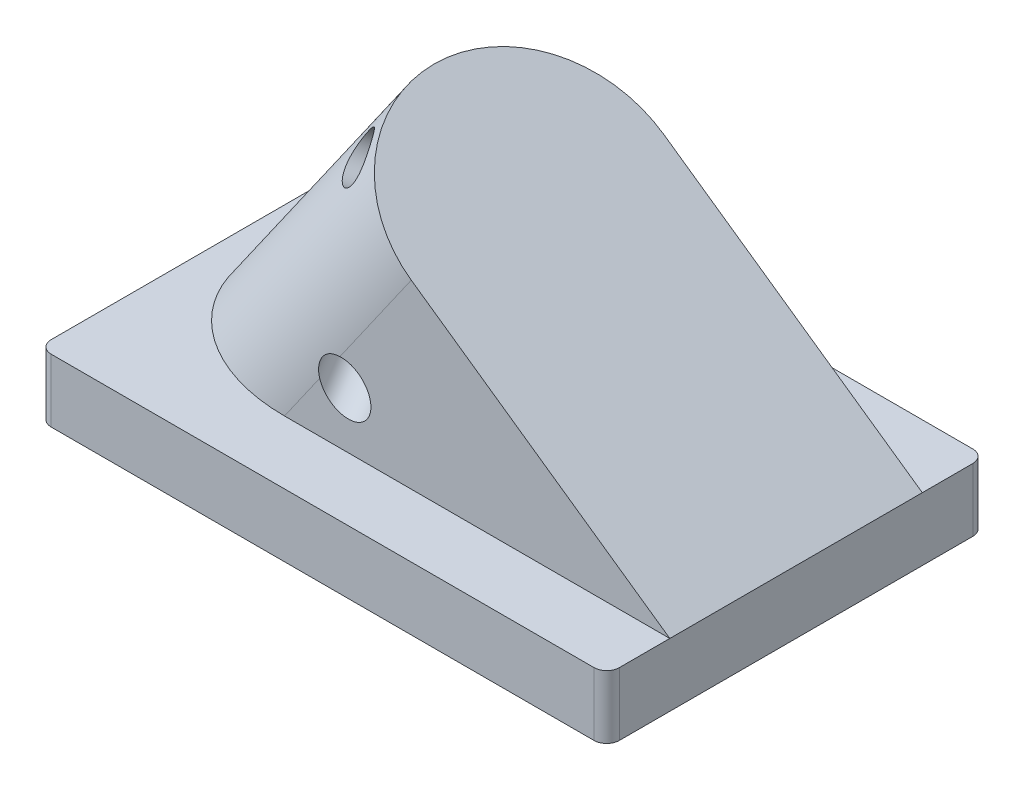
ISO-10303-21;
HEADER;
FILE_DESCRIPTION(('STEP AP214'),'2;1');
FILE_NAME('part.step','',(''),(''),'','','');
FILE_SCHEMA(('AUTOMOTIVE_DESIGN { 1 0 10303 214 1 1 1 1 }'));
ENDSEC;
DATA;
#1=APPLICATION_CONTEXT('core data for automotive mechanical design processes');
#2=APPLICATION_PROTOCOL_DEFINITION('international standard','automotive_design',2000,#1);
#3=PRODUCT_CONTEXT('',#1,'mechanical');
#4=PRODUCT('Part','Part','',(#3));
#5=PRODUCT_RELATED_PRODUCT_CATEGORY('part','',(#4));
#6=PRODUCT_DEFINITION_FORMATION('','',#4);
#7=PRODUCT_DEFINITION_CONTEXT('part definition',#1,'design');
#8=PRODUCT_DEFINITION('design','',#6,#7);
#9=PRODUCT_DEFINITION_SHAPE('','',#8);
#10=(LENGTH_UNIT() NAMED_UNIT(*) SI_UNIT(.MILLI.,.METRE.));
#11=(NAMED_UNIT(*) PLANE_ANGLE_UNIT() SI_UNIT($,.RADIAN.));
#12=(NAMED_UNIT(*) SI_UNIT($,.STERADIAN.) SOLID_ANGLE_UNIT());
#13=UNCERTAINTY_MEASURE_WITH_UNIT(LENGTH_MEASURE(1.E-05),#10,'distance_accuracy_value','');
#14=(GEOMETRIC_REPRESENTATION_CONTEXT(3) GLOBAL_UNCERTAINTY_ASSIGNED_CONTEXT((#13)) GLOBAL_UNIT_ASSIGNED_CONTEXT((#10,
#11,#12)) REPRESENTATION_CONTEXT('',''));
#15=CARTESIAN_POINT('',(0.,0.,0.));
#16=DIRECTION('',(0.,0.,1.));
#17=DIRECTION('',(1.,0.,0.));
#18=AXIS2_PLACEMENT_3D('',#15,#16,#17);
#19=CARTESIAN_POINT('',(57.15,12.7,38.1));
#20=DIRECTION('',(-1.,0.,0.));
#21=DIRECTION('',(0.,0.,1.));
#22=AXIS2_PLACEMENT_3D('',#19,#20,#21);
#23=PLANE('',#22);
#24=DIRECTION('',(0.,0.,-1.));
#25=VECTOR('',#24,1.);
#26=CARTESIAN_POINT('',(57.15,0.,38.1));
#27=LINE('',#26,#25);
#28=CARTESIAN_POINT('',(57.15,0.,35.56));
#29=VERTEX_POINT('',#28);
#30=CARTESIAN_POINT('',(57.15,0.,-35.56));
#31=VERTEX_POINT('',#30);
#32=EDGE_CURVE('E168',#29,#31,#27,.T.);
#33=ORIENTED_EDGE('',*,*,#32,.T.);
#34=DIRECTION('',(0.,-1.,0.));
#35=VECTOR('',#34,1.);
#36=CARTESIAN_POINT('',(57.15,12.7,-35.56));
#37=LINE('',#36,#35);
#38=CARTESIAN_POINT('',(57.15,12.7,-35.56));
#39=VERTEX_POINT('',#38);
#40=EDGE_CURVE('E267',#31,#39,#37,.F.);
#41=ORIENTED_EDGE('',*,*,#40,.T.);
#42=DIRECTION('',(0.,0.,-1.));
#43=VECTOR('',#42,1.);
#44=CARTESIAN_POINT('',(57.15,12.7,38.1));
#45=LINE('',#44,#43);
#46=CARTESIAN_POINT('',(57.15,12.7,-25.4));
#47=VERTEX_POINT('',#46);
#48=EDGE_CURVE('E180',#47,#39,#45,.T.);
#49=ORIENTED_EDGE('',*,*,#48,.F.);
#50=DIRECTION('',(0.,0.,-1.));
#51=VECTOR('',#50,1.);
#52=CARTESIAN_POINT('',(57.15,12.7,25.4));
#53=LINE('',#52,#51);
#54=CARTESIAN_POINT('',(57.15,12.7,25.4));
#55=VERTEX_POINT('',#54);
#56=EDGE_CURVE('E336',#55,#47,#53,.T.);
#57=ORIENTED_EDGE('',*,*,#56,.F.);
#58=CARTESIAN_POINT('',(57.15,12.7,35.56));
#59=VERTEX_POINT('',#58);
#60=EDGE_CURVE('E177',#59,#55,#45,.T.);
#61=ORIENTED_EDGE('',*,*,#60,.F.);
#62=DIRECTION('',(0.,-1.,0.));
#63=VECTOR('',#62,1.);
#64=CARTESIAN_POINT('',(57.15,12.7,35.56));
#65=LINE('',#64,#63);
#66=EDGE_CURVE('E255',#59,#29,#65,.T.);
#67=ORIENTED_EDGE('',*,*,#66,.T.);
#68=EDGE_LOOP('',(#33,#41,#49,#57,#61,#67));
#69=FACE_BOUND('',#68,.T.);
#70=ADVANCED_FACE('F48',(#69),#23,.F.);
#71=CARTESIAN_POINT('',(-57.15,12.7,-38.1));
#72=DIRECTION('',(0.,0.,1.));
#73=DIRECTION('',(1.,0.,0.));
#74=AXIS2_PLACEMENT_3D('',#71,#72,#73);
#75=PLANE('',#74);
#76=DIRECTION('',(-1.,0.,0.));
#77=VECTOR('',#76,1.);
#78=CARTESIAN_POINT('',(-57.15,0.,-38.1));
#79=LINE('',#78,#77);
#80=CARTESIAN_POINT('',(54.61,0.,-38.1));
#81=VERTEX_POINT('',#80);
#82=CARTESIAN_POINT('',(-54.61,0.,-38.1));
#83=VERTEX_POINT('',#82);
#84=EDGE_CURVE('E171',#81,#83,#79,.T.);
#85=ORIENTED_EDGE('',*,*,#84,.T.);
#86=DIRECTION('',(0.,-1.,0.));
#87=VECTOR('',#86,1.);
#88=CARTESIAN_POINT('',(-54.61,12.7,-38.1));
#89=LINE('',#88,#87);
#90=CARTESIAN_POINT('',(-54.61,12.7,-38.1));
#91=VERTEX_POINT('',#90);
#92=EDGE_CURVE('E261',#83,#91,#89,.F.);
#93=ORIENTED_EDGE('',*,*,#92,.T.);
#94=DIRECTION('',(-1.,0.,0.));
#95=VECTOR('',#94,1.);
#96=CARTESIAN_POINT('',(-57.15,12.7,-38.1));
#97=LINE('',#96,#95);
#98=CARTESIAN_POINT('',(54.61,12.7,-38.1));
#99=VERTEX_POINT('',#98);
#100=EDGE_CURVE('E179',#99,#91,#97,.T.);
#101=ORIENTED_EDGE('',*,*,#100,.F.);
#102=DIRECTION('',(0.,-1.,0.));
#103=VECTOR('',#102,1.);
#104=CARTESIAN_POINT('',(54.61,12.7,-38.1));
#105=LINE('',#104,#103);
#106=EDGE_CURVE('E288',#99,#81,#105,.T.);
#107=ORIENTED_EDGE('',*,*,#106,.T.);
#108=EDGE_LOOP('',(#85,#93,#101,#107));
#109=FACE_BOUND('',#108,.T.);
#110=ADVANCED_FACE('F228',(#109),#75,.F.);
#111=CARTESIAN_POINT('',(-57.15,12.7,38.1));
#112=DIRECTION('',(1.,0.,0.));
#113=DIRECTION('',(0.,0.,-1.));
#114=AXIS2_PLACEMENT_3D('',#111,#112,#113);
#115=PLANE('',#114);
#116=DIRECTION('',(0.,0.,1.));
#117=VECTOR('',#116,1.);
#118=CARTESIAN_POINT('',(-57.15,12.7,38.1));
#119=LINE('',#118,#117);
#120=CARTESIAN_POINT('',(-57.15,12.7,-35.56));
#121=VERTEX_POINT('',#120);
#122=CARTESIAN_POINT('',(-57.15,12.7,35.56));
#123=VERTEX_POINT('',#122);
#124=EDGE_CURVE('E183',#121,#123,#119,.T.);
#125=ORIENTED_EDGE('',*,*,#124,.F.);
#126=DIRECTION('',(0.,-1.,0.));
#127=VECTOR('',#126,1.);
#128=CARTESIAN_POINT('',(-57.15,12.7,-35.56));
#129=LINE('',#128,#127);
#130=CARTESIAN_POINT('',(-57.15,0.,-35.56));
#131=VERTEX_POINT('',#130);
#132=EDGE_CURVE('E283',#121,#131,#129,.T.);
#133=ORIENTED_EDGE('',*,*,#132,.T.);
#134=DIRECTION('',(0.,0.,1.));
#135=VECTOR('',#134,1.);
#136=CARTESIAN_POINT('',(-57.15,0.,38.1));
#137=LINE('',#136,#135);
#138=CARTESIAN_POINT('',(-57.15,0.,-32.0762778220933));
#139=VERTEX_POINT('',#138);
#140=EDGE_CURVE('E192',#131,#139,#137,.T.);
#141=ORIENTED_EDGE('',*,*,#140,.T.);
#142=CARTESIAN_POINT('',(-57.15,-55.6483652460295,0.));
#143=DIRECTION('',(1.,0.,0.));
#144=DIRECTION('',(0.,1.,0.));
#145=AXIS2_PLACEMENT_3D('',#142,#143,#144);
#146=ELLIPSE('',#145,64.4795898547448,63.5);
#147=CARTESIAN_POINT('',(-57.15,0.,32.0762778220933));
#148=VERTEX_POINT('',#147);
#149=EDGE_CURVE('E161',#139,#148,#146,.T.);
#150=ORIENTED_EDGE('',*,*,#149,.T.);
#151=CARTESIAN_POINT('',(-57.15,0.,35.56));
#152=VERTEX_POINT('',#151);
#153=EDGE_CURVE('E191',#148,#152,#137,.T.);
#154=ORIENTED_EDGE('',*,*,#153,.T.);
#155=DIRECTION('',(0.,-1.,0.));
#156=VECTOR('',#155,1.);
#157=CARTESIAN_POINT('',(-57.15,12.7,35.56));
#158=LINE('',#157,#156);
#159=EDGE_CURVE('E150',#152,#123,#158,.F.);
#160=ORIENTED_EDGE('',*,*,#159,.T.);
#161=EDGE_LOOP('',(#125,#133,#141,#150,#154,#160));
#162=FACE_BOUND('',#161,.T.);
#163=ADVANCED_FACE('F234',(#162),#115,.F.);
#164=CARTESIAN_POINT('',(-57.15,12.7,38.1));
#165=DIRECTION('',(0.,0.,-1.));
#166=DIRECTION('',(-1.,0.,0.));
#167=AXIS2_PLACEMENT_3D('',#164,#165,#166);
#168=PLANE('',#167);
#169=DIRECTION('',(1.,0.,0.));
#170=VECTOR('',#169,1.);
#171=CARTESIAN_POINT('',(-57.15,0.,38.1));
#172=LINE('',#171,#170);
#173=CARTESIAN_POINT('',(-54.61,0.,38.1));
#174=VERTEX_POINT('',#173);
#175=CARTESIAN_POINT('',(54.61,0.,38.1));
#176=VERTEX_POINT('',#175);
#177=EDGE_CURVE('E194',#174,#176,#172,.T.);
#178=ORIENTED_EDGE('',*,*,#177,.T.);
#179=DIRECTION('',(0.,-1.,0.));
#180=VECTOR('',#179,1.);
#181=CARTESIAN_POINT('',(54.61,12.7,38.1));
#182=LINE('',#181,#180);
#183=CARTESIAN_POINT('',(54.61,12.7,38.1));
#184=VERTEX_POINT('',#183);
#185=EDGE_CURVE('E13',#176,#184,#182,.F.);
#186=ORIENTED_EDGE('',*,*,#185,.T.);
#187=DIRECTION('',(1.,0.,0.));
#188=VECTOR('',#187,1.);
#189=CARTESIAN_POINT('',(-57.15,12.7,38.1));
#190=LINE('',#189,#188);
#191=CARTESIAN_POINT('',(-54.61,12.7,38.1));
#192=VERTEX_POINT('',#191);
#193=EDGE_CURVE('E186',#192,#184,#190,.T.);
#194=ORIENTED_EDGE('',*,*,#193,.F.);
#195=DIRECTION('',(0.,-1.,0.));
#196=VECTOR('',#195,1.);
#197=CARTESIAN_POINT('',(-54.61,12.7,38.1));
#198=LINE('',#197,#196);
#199=EDGE_CURVE('E56',#192,#174,#198,.T.);
#200=ORIENTED_EDGE('',*,*,#199,.T.);
#201=EDGE_LOOP('',(#178,#186,#194,#200));
#202=FACE_BOUND('',#201,.T.);
#203=ADVANCED_FACE('F271',(#202),#168,.F.);
#204=CARTESIAN_POINT('',(0.,12.7,0.));
#205=DIRECTION('',(0.,-1.,0.));
#206=DIRECTION('',(0.,0.,-1.));
#207=AXIS2_PLACEMENT_3D('',#204,#205,#206);
#208=PLANE('',#207);
#209=ORIENTED_EDGE('',*,*,#100,.T.);
#210=CARTESIAN_POINT('',(-54.61,12.7,-35.56));
#211=DIRECTION('',(0.,-1.,0.));
#212=DIRECTION('',(0.,0.,-1.));
#213=AXIS2_PLACEMENT_3D('',#210,#211,#212);
#214=CIRCLE('',#213,2.54);
#215=EDGE_CURVE('E259',#91,#121,#214,.F.);
#216=ORIENTED_EDGE('',*,*,#215,.T.);
#217=ORIENTED_EDGE('',*,*,#124,.T.);
#218=CARTESIAN_POINT('',(-54.61,12.7,35.56));
#219=DIRECTION('',(0.,-1.,0.));
#220=DIRECTION('',(0.,0.,-1.));
#221=AXIS2_PLACEMENT_3D('',#218,#219,#220);
#222=CIRCLE('',#221,2.54);
#223=EDGE_CURVE('E257',#123,#192,#222,.F.);
#224=ORIENTED_EDGE('',*,*,#223,.T.);
#225=ORIENTED_EDGE('',*,*,#193,.T.);
#226=CARTESIAN_POINT('',(54.61,12.7,35.56));
#227=DIRECTION('',(0.,-1.,0.));
#228=DIRECTION('',(0.,0.,-1.));
#229=AXIS2_PLACEMENT_3D('',#226,#227,#228);
#230=CIRCLE('',#229,2.54);
#231=EDGE_CURVE('E63',#184,#59,#230,.F.);
#232=ORIENTED_EDGE('',*,*,#231,.T.);
#233=ORIENTED_EDGE('',*,*,#60,.T.);
#234=DIRECTION('',(1.,0.,0.));
#235=VECTOR('',#234,1.);
#236=CARTESIAN_POINT('',(-77.9300763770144,12.7,25.4));
#237=LINE('',#236,#235);
#238=CARTESIAN_POINT('',(-20.3691863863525,12.7,25.4));
#239=VERTEX_POINT('',#238);
#240=EDGE_CURVE('E335',#239,#55,#237,.T.);
#241=ORIENTED_EDGE('',*,*,#240,.F.);
#242=CARTESIAN_POINT('',(-20.3691863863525,12.7,0.));
#243=DIRECTION('',(0.,-1.,0.));
#244=DIRECTION('',(1.,0.,0.));
#245=AXIS2_PLACEMENT_3D('',#242,#243,#244);
#246=ELLIPSE('',#245,31.007674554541,25.4);
#247=CARTESIAN_POINT('',(-20.3691863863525,12.7,-25.4));
#248=VERTEX_POINT('',#247);
#249=EDGE_CURVE('E167',#248,#239,#246,.F.);
#250=ORIENTED_EDGE('',*,*,#249,.F.);
#251=DIRECTION('',(-1.,0.,0.));
#252=VECTOR('',#251,1.);
#253=CARTESIAN_POINT('',(-25.9139215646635,12.7,-25.4));
#254=LINE('',#253,#252);
#255=EDGE_CURVE('E344',#47,#248,#254,.T.);
#256=ORIENTED_EDGE('',*,*,#255,.F.);
#257=ORIENTED_EDGE('',*,*,#48,.T.);
#258=CARTESIAN_POINT('',(54.61,12.7,-35.56));
#259=DIRECTION('',(0.,-1.,0.));
#260=DIRECTION('',(0.,0.,-1.));
#261=AXIS2_PLACEMENT_3D('',#258,#259,#260);
#262=CIRCLE('',#261,2.54);
#263=EDGE_CURVE('E256',#39,#99,#262,.F.);
#264=ORIENTED_EDGE('',*,*,#263,.T.);
#265=EDGE_LOOP('',(#209,#216,#217,#224,#225,#232,#233,#241,#250,#256,#257,#264));
#266=FACE_BOUND('',#265,.T.);
#267=ADVANCED_FACE('F223',(#266),#208,.F.);
#268=CARTESIAN_POINT('',(0.,0.,0.));
#269=DIRECTION('',(0.,-1.,0.));
#270=DIRECTION('',(0.,0.,-1.));
#271=AXIS2_PLACEMENT_3D('',#268,#269,#270);
#272=PLANE('',#271);
#273=ORIENTED_EDGE('',*,*,#140,.F.);
#274=CARTESIAN_POINT('',(-54.61,0.,-35.56));
#275=DIRECTION('',(0.,-1.,0.));
#276=DIRECTION('',(0.,0.,-1.));
#277=AXIS2_PLACEMENT_3D('',#274,#275,#276);
#278=CIRCLE('',#277,2.54);
#279=EDGE_CURVE('E281',#131,#83,#278,.T.);
#280=ORIENTED_EDGE('',*,*,#279,.T.);
#281=ORIENTED_EDGE('',*,*,#84,.F.);
#282=CARTESIAN_POINT('',(54.61,0.,-35.56));
#283=DIRECTION('',(0.,-1.,0.));
#284=DIRECTION('',(0.,0.,-1.));
#285=AXIS2_PLACEMENT_3D('',#282,#283,#284);
#286=CIRCLE('',#285,2.54);
#287=EDGE_CURVE('E279',#81,#31,#286,.T.);
#288=ORIENTED_EDGE('',*,*,#287,.T.);
#289=ORIENTED_EDGE('',*,*,#32,.F.);
#290=CARTESIAN_POINT('',(54.61,0.,35.56));
#291=DIRECTION('',(0.,-1.,0.));
#292=DIRECTION('',(0.,0.,-1.));
#293=AXIS2_PLACEMENT_3D('',#290,#291,#292);
#294=CIRCLE('',#293,2.54);
#295=EDGE_CURVE('E278',#29,#176,#294,.T.);
#296=ORIENTED_EDGE('',*,*,#295,.T.);
#297=ORIENTED_EDGE('',*,*,#177,.F.);
#298=CARTESIAN_POINT('',(-54.61,0.,35.56));
#299=DIRECTION('',(0.,-1.,0.));
#300=DIRECTION('',(0.,0.,-1.));
#301=AXIS2_PLACEMENT_3D('',#298,#299,#300);
#302=CIRCLE('',#301,2.54);
#303=EDGE_CURVE('E275',#174,#152,#302,.T.);
#304=ORIENTED_EDGE('',*,*,#303,.T.);
#305=ORIENTED_EDGE('',*,*,#153,.F.);
#306=CARTESIAN_POINT('',(-372.747562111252,0.,0.));
#307=DIRECTION('',(0.,-1.,0.));
#308=DIRECTION('',(-1.,0.,0.));
#309=AXIS2_PLACEMENT_3D('',#306,#307,#308);
#310=ELLIPSE('',#309,365.68192567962,63.5);
#311=EDGE_CURVE('E151',#139,#148,#310,.T.);
#312=ORIENTED_EDGE('',*,*,#311,.F.);
#313=EDGE_LOOP('',(#273,#280,#281,#288,#289,#296,#297,#304,#305,#312));
#314=FACE_BOUND('',#313,.T.);
#315=ADVANCED_FACE('F215',(#314),#272,.T.);
#316=CARTESIAN_POINT('',(5.13384518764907,49.1221037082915,0.));
#317=DIRECTION('',(0.573576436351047,0.819152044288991,0.));
#318=DIRECTION('',(-0.819152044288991,0.573576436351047,0.));
#319=AXIS2_PLACEMENT_3D('',#316,#317,#318);
#320=PLANE('',#319);
#321=CARTESIAN_POINT('',(5.13384518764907,49.1221037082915,0.));
#322=DIRECTION('',(0.573576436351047,0.819152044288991,0.));
#323=DIRECTION('',(-0.819152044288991,0.573576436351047,0.));
#324=AXIS2_PLACEMENT_3D('',#321,#322,#323);
#325=CIRCLE('',#324,25.4);
#326=CARTESIAN_POINT('',(5.13384518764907,49.1221037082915,-25.4));
#327=VERTEX_POINT('',#326);
#328=CARTESIAN_POINT('',(5.13384518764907,49.1221037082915,25.4));
#329=VERTEX_POINT('',#328);
#330=EDGE_CURVE('E331',#327,#329,#325,.T.);
#331=ORIENTED_EDGE('',*,*,#330,.T.);
#332=DIRECTION('',(0.819152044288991,-0.573576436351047,0.));
#333=VECTOR('',#332,1.);
#334=CARTESIAN_POINT('',(5.13384518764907,49.1221037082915,25.4));
#335=LINE('',#334,#333);
#336=EDGE_CURVE('E337',#329,#55,#335,.T.);
#337=ORIENTED_EDGE('',*,*,#336,.T.);
#338=ORIENTED_EDGE('',*,*,#56,.T.);
#339=DIRECTION('',(-0.819152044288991,0.573576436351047,0.));
#340=VECTOR('',#339,1.);
#341=CARTESIAN_POINT('',(57.15,12.7,-25.4));
#342=LINE('',#341,#340);
#343=EDGE_CURVE('E332',#47,#327,#342,.T.);
#344=ORIENTED_EDGE('',*,*,#343,.T.);
#345=EDGE_LOOP('',(#331,#337,#338,#344));
#346=FACE_BOUND('',#345,.T.);
#347=ADVANCED_FACE('F213',(#346),#320,.T.);
#348=CARTESIAN_POINT('',(-77.9300763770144,-69.5054703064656,25.4));
#349=DIRECTION('',(0.,0.,1.));
#350=DIRECTION('',(1.,0.,0.));
#351=AXIS2_PLACEMENT_3D('',#348,#349,#350);
#352=PLANE('',#351);
#353=CARTESIAN_POINT('',(-8.25294738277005,23.6120029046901,25.4));
#354=DIRECTION('',(0.,0.,1.));
#355=DIRECTION('',(-0.819152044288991,0.573576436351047,0.));
#356=AXIS2_PLACEMENT_3D('',#353,#354,#355);
#357=ELLIPSE('',#356,5.49926131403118,4.76249999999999);
#358=CARTESIAN_POINT('',(-13.2921589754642,22.8070425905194,25.4));
#359=VERTEX_POINT('',#358);
#360=CARTESIAN_POINT('',(-9.22004398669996,28.6226254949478,25.4));
#361=VERTEX_POINT('',#360);
#362=EDGE_CURVE('E146',#359,#361,#357,.T.);
#363=ORIENTED_EDGE('',*,*,#362,.F.);
#364=DIRECTION('',(0.573576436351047,0.819152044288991,0.));
#365=VECTOR('',#364,1.);
#366=CARTESIAN_POINT('',(-77.9300763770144,-69.5054703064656,25.4));
#367=LINE('',#366,#365);
#368=EDGE_CURVE('E157',#239,#359,#367,.T.);
#369=ORIENTED_EDGE('',*,*,#368,.F.);
#370=ORIENTED_EDGE('',*,*,#240,.T.);
#371=ORIENTED_EDGE('',*,*,#336,.F.);
#372=EDGE_CURVE('E160',#361,#329,#367,.T.);
#373=ORIENTED_EDGE('',*,*,#372,.F.);
#374=EDGE_LOOP('',(#363,#369,#370,#371,#373));
#375=FACE_BOUND('',#374,.T.);
#376=ADVANCED_FACE('F155',(#375),#352,.T.);
#377=CARTESIAN_POINT('',(-25.9139215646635,-105.927574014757,-25.4));
#378=DIRECTION('',(0.,0.,-1.));
#379=DIRECTION('',(-1.,0.,0.));
#380=AXIS2_PLACEMENT_3D('',#377,#378,#379);
#381=PLANE('',#380);
#382=CARTESIAN_POINT('',(16.440038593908,31.5000197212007,-25.4));
#383=DIRECTION('',(0.,0.,-1.));
#384=DIRECTION('',(-0.819152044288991,0.573576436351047,0.));
#385=AXIS2_PLACEMENT_3D('',#382,#383,#384);
#386=ELLIPSE('',#385,6.73519209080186,4.76249999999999);
#387=CARTESIAN_POINT('',(10.9228922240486,35.3631671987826,-25.4));
#388=VERTEX_POINT('',#387);
#389=EDGE_CURVE('E327',#388,#388,#386,.T.);
#390=ORIENTED_EDGE('',*,*,#389,.F.);
#391=EDGE_LOOP('',(#390));
#392=FACE_BOUND('',#391,.T.);
#393=ORIENTED_EDGE('',*,*,#343,.F.);
#394=ORIENTED_EDGE('',*,*,#255,.T.);
#395=DIRECTION('',(0.573576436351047,0.819152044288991,0.));
#396=VECTOR('',#395,1.);
#397=CARTESIAN_POINT('',(-77.9300763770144,-69.5054703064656,-25.4));
#398=LINE('',#397,#396);
#399=EDGE_CURVE('E175',#248,#327,#398,.T.);
#400=ORIENTED_EDGE('',*,*,#399,.T.);
#401=EDGE_LOOP('',(#393,#394,#400));
#402=FACE_BOUND('',#401,.T.);
#403=ADVANCED_FACE('F221',(#392,#402),#381,.T.);
#404=CARTESIAN_POINT('',(-77.9300763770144,-69.5054703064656,0.));
#405=DIRECTION('',(0.573576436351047,0.819152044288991,0.));
#406=DIRECTION('',(-0.819152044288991,0.573576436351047,0.));
#407=AXIS2_PLACEMENT_3D('',#404,#405,#406);
#408=CYLINDRICAL_SURFACE('',#407,25.4);
#409=CARTESIAN_POINT('',(-9.22004398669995,28.6226254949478,25.4));
#410=CARTESIAN_POINT('',(-9.35832581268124,28.6159547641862,25.4000043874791));
#411=CARTESIAN_POINT('',(-9.4963873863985,28.6041384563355,25.3992925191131));
#412=CARTESIAN_POINT('',(-9.77127681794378,28.5699318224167,25.3967124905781));
#413=CARTESIAN_POINT('',(-9.90810374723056,28.5475341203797,25.3948435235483));
#414=CARTESIAN_POINT('',(-10.1806100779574,28.4916700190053,25.3902079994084));
#415=CARTESIAN_POINT('',(-10.3162718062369,28.4581173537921,25.3874344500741));
#416=CARTESIAN_POINT('',(-10.5842779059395,28.3797396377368,25.381307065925));
#417=CARTESIAN_POINT('',(-10.7166227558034,28.3349162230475,25.377953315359));
#418=CARTESIAN_POINT('',(-10.9775389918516,28.2335344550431,25.3709729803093));
#419=CARTESIAN_POINT('',(-11.1060873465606,28.1769166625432,25.3673450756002));
#420=CARTESIAN_POINT('',(-11.3573263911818,28.0520353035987,25.3601698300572));
#421=CARTESIAN_POINT('',(-11.480020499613,27.9837786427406,25.3566224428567));
#422=CARTESIAN_POINT('',(-11.717861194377,27.835920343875,25.3499401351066));
#423=CARTESIAN_POINT('',(-11.8330305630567,27.756355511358,25.3468039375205));
#424=CARTESIAN_POINT('',(-12.0548026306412,27.5860503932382,25.3412188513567));
#425=CARTESIAN_POINT('',(-12.1614069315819,27.4953122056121,25.3387698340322));
#426=CARTESIAN_POINT('',(-12.3523475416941,27.3149124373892,25.3350277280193));
#427=CARTESIAN_POINT('',(-12.4378172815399,27.2264502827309,25.3336305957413));
#428=CARTESIAN_POINT('',(-12.6001986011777,27.041988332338,25.3316449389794));
#429=CARTESIAN_POINT('',(-12.6771111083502,26.9459893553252,25.3310563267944));
#430=CARTESIAN_POINT('',(-12.8216626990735,26.7472091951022,25.3307315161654));
#431=CARTESIAN_POINT('',(-12.889299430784,26.6444263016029,25.3309955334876));
#432=CARTESIAN_POINT('',(-13.0147150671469,26.4330248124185,25.3323566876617));
#433=CARTESIAN_POINT('',(-13.0724943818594,26.3244064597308,25.3334537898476));
#434=CARTESIAN_POINT('',(-13.172875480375,26.1128033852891,25.3362609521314));
#435=CARTESIAN_POINT('',(-13.2163941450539,26.0102513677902,25.337903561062));
#436=CARTESIAN_POINT('',(-13.2949471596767,25.8019469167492,25.3417056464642));
#437=CARTESIAN_POINT('',(-13.3299788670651,25.6961934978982,25.3438652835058));
#438=CARTESIAN_POINT('',(-13.4222771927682,25.375347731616,25.350933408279));
#439=CARTESIAN_POINT('',(-13.4668301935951,25.1564922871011,25.3564338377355));
#440=CARTESIAN_POINT('',(-13.5247703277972,24.7014598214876,25.3681092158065));
#441=CARTESIAN_POINT('',(-13.5361090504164,24.4650358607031,25.374304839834));
#442=CARTESIAN_POINT('',(-13.5244618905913,23.9930090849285,25.3854640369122));
#443=CARTESIAN_POINT('',(-13.5014705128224,23.757406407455,25.3904274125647));
#444=CARTESIAN_POINT('',(-13.4425964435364,23.4030318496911,25.3958888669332));
#445=CARTESIAN_POINT('',(-13.4181283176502,23.2822442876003,25.3973873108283));
#446=CARTESIAN_POINT('',(-13.3611021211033,23.0429310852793,25.3994424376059));
#447=CARTESIAN_POINT('',(-13.3285662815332,22.9244001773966,25.4000016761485));
#448=CARTESIAN_POINT('',(-13.2921589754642,22.8070425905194,25.4));
#449=B_SPLINE_CURVE_WITH_KNOTS('',3,(#409,#410,#411,#412,#413,#414,#415,#416,#417,#418,#419,
#420,#421,#422,#423,#424,#425,#426,#427,#428,#429,#430,#431,#432,#433,#434,#435,#436,#437,#438,
#439,#440,#441,#442,#443,#444,#445,#446,#447,#448),.UNSPECIFIED.,.F.,.F.,(4,2,2,2,2,2,2,2,2,2,2,
2,2,2,2,2,2,2,2,4),(0.,0.415272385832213,0.830834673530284,1.24968847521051,1.66848150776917,
2.08943849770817,2.51014658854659,2.92951546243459,3.34880571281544,3.71733780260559,
4.08582991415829,4.45441528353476,4.82298531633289,5.15684718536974,5.49081287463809,
6.15816270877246,6.86588356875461,7.57371772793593,7.94322023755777,8.31171565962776),.UNSPECIFIED.);
#450=EDGE_CURVE('E142',#361,#359,#449,.T.);
#451=ORIENTED_EDGE('',*,*,#450,.F.);
#452=ORIENTED_EDGE('',*,*,#372,.T.);
#453=ORIENTED_EDGE('',*,*,#330,.F.);
#454=ORIENTED_EDGE('',*,*,#399,.F.);
#455=ORIENTED_EDGE('',*,*,#249,.T.);
#456=ORIENTED_EDGE('',*,*,#368,.T.);
#457=EDGE_LOOP('',(#451,#452,#453,#454,#455,#456));
#458=FACE_BOUND('',#457,.T.);
#459=CARTESIAN_POINT('',(-31.1055372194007,36.59895916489,-11.7810752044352));
#460=CARTESIAN_POINT('',(-31.0468432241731,36.7960351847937,-11.6570007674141));
#461=CARTESIAN_POINT('',(-30.9757460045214,36.9974051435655,-11.5451270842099));
#462=CARTESIAN_POINT('',(-30.8513333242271,37.3027285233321,-11.4001289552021));
#463=CARTESIAN_POINT('',(-30.806894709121,37.4050605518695,-11.3555942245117));
#464=CARTESIAN_POINT('',(-30.7122802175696,37.6103132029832,-11.2747540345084));
#465=CARTESIAN_POINT('',(-30.6621065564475,37.7132335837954,-11.2384454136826));
#466=CARTESIAN_POINT('',(-30.5559895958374,37.9196043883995,-11.1744896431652));
#467=CARTESIAN_POINT('',(-30.5000145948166,38.0230544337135,-11.1468938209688));
#468=CARTESIAN_POINT('',(-30.3829353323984,38.2290919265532,-11.1011746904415));
#469=CARTESIAN_POINT('',(-30.3218332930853,38.3316797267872,-11.0830473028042));
#470=CARTESIAN_POINT('',(-30.1949451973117,38.5352114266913,-11.0566127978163));
#471=CARTESIAN_POINT('',(-30.1291592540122,38.636155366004,-11.0483054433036));
#472=CARTESIAN_POINT('',(-29.9934437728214,38.8355516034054,-11.0416841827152));
#473=CARTESIAN_POINT('',(-29.9235144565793,38.9340040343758,-11.0433697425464));
#474=CARTESIAN_POINT('',(-29.7849875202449,39.1209975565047,-11.0562420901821));
#475=CARTESIAN_POINT('',(-29.7166229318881,39.2097572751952,-11.0667747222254));
#476=CARTESIAN_POINT('',(-29.577283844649,39.3837961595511,-11.0962993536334));
#477=CARTESIAN_POINT('',(-29.5063084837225,39.4690741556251,-11.1152941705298));
#478=CARTESIAN_POINT('',(-29.362277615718,39.6355367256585,-11.1614153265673));
#479=CARTESIAN_POINT('',(-29.289222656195,39.716722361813,-11.1885395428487));
#480=CARTESIAN_POINT('',(-29.1414737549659,39.874560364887,-11.2504803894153));
#481=CARTESIAN_POINT('',(-29.0667791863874,39.951210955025,-11.2853000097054));
#482=CARTESIAN_POINT('',(-28.8383511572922,40.1762305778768,-11.4018593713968));
#483=CARTESIAN_POINT('',(-28.6826483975,40.3169238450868,-11.494921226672));
#484=CARTESIAN_POINT('',(-28.3693937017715,40.5754130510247,-11.7059502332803));
#485=CARTESIAN_POINT('',(-28.2118410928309,40.6932003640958,-11.8239267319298));
#486=CARTESIAN_POINT('',(-27.8758360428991,40.918927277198,-12.0972635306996));
#487=CARTESIAN_POINT('',(-27.6974196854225,41.0234174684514,-12.2555169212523));
#488=CARTESIAN_POINT('',(-27.343319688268,41.2004370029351,-12.5917104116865));
#489=CARTESIAN_POINT('',(-27.1676377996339,41.2729466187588,-12.7696625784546));
#490=CARTESIAN_POINT('',(-26.794231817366,41.3940430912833,-13.1683720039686));
#491=CARTESIAN_POINT('',(-26.5972802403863,41.4372254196,-13.391500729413));
#492=CARTESIAN_POINT('',(-26.2124185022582,41.4793261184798,-13.8497119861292));
#493=CARTESIAN_POINT('',(-26.0245130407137,41.4782217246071,-14.0848006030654));
#494=CARTESIAN_POINT('',(-25.7451729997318,41.4419394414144,-14.4504368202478));
#495=CARTESIAN_POINT('',(-25.6491630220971,41.4226875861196,-14.5792694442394));
#496=CARTESIAN_POINT('',(-25.4614667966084,41.3710535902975,-14.8374309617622));
#497=CARTESIAN_POINT('',(-25.3697789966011,41.3386762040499,-14.9667596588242));
#498=CARTESIAN_POINT('',(-25.1913889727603,41.2607683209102,-15.2249664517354));
#499=CARTESIAN_POINT('',(-25.1046886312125,41.2152328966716,-15.3538443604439));
#500=CARTESIAN_POINT('',(-24.937125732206,41.1111198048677,-15.6100362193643));
#501=CARTESIAN_POINT('',(-24.8562603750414,41.052548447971,-15.737350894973));
#502=CARTESIAN_POINT('',(-24.7034338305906,40.9244499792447,-15.985778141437));
#503=CARTESIAN_POINT('',(-24.6312819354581,40.85529153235,-16.1069633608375));
#504=CARTESIAN_POINT('',(-24.4940958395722,40.7052188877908,-16.3459582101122));
#505=CARTESIAN_POINT('',(-24.4290584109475,40.6243100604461,-16.4637693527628));
#506=CARTESIAN_POINT('',(-24.306928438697,40.4512139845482,-16.6951153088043));
#507=CARTESIAN_POINT('',(-24.2498343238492,40.3590289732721,-16.8086509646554));
#508=CARTESIAN_POINT('',(-24.144431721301,40.1640294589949,-17.0305550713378));
#509=CARTESIAN_POINT('',(-24.096122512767,40.0612158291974,-17.1389239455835));
#510=CARTESIAN_POINT('',(-24.0125672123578,39.8543611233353,-17.3412595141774));
#511=CARTESIAN_POINT('',(-23.9765886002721,39.7510652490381,-17.4356866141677));
#512=CARTESIAN_POINT('',(-23.913373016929,39.5369799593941,-17.6187933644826));
#513=CARTESIAN_POINT('',(-23.8861353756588,39.4261911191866,-17.7074734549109));
#514=CARTESIAN_POINT('',(-23.8409427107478,39.1980634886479,-17.8784883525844));
#515=CARTESIAN_POINT('',(-23.8229852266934,39.0807264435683,-17.9608248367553));
#516=CARTESIAN_POINT('',(-23.7967980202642,38.8405001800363,-18.1186625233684));
#517=CARTESIAN_POINT('',(-23.7885679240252,38.7176111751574,-18.194163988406));
#518=CARTESIAN_POINT('',(-23.7823856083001,38.4749757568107,-18.3335319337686));
#519=CARTESIAN_POINT('',(-23.7838413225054,38.3554895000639,-18.397826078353));
#520=CARTESIAN_POINT('',(-23.795864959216,38.1135321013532,-18.5196984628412));
#521=CARTESIAN_POINT('',(-23.8064359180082,37.9910599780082,-18.5772744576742));
#522=CARTESIAN_POINT('',(-23.8368073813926,37.7442453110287,-18.6853968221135));
#523=CARTESIAN_POINT('',(-23.8566033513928,37.6199037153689,-18.7359466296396));
#524=CARTESIAN_POINT('',(-23.9054588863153,37.3702735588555,-18.829858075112));
#525=CARTESIAN_POINT('',(-23.9345218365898,37.2449846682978,-18.8732170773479));
#526=CARTESIAN_POINT('',(-24.0010049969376,36.9976443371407,-18.9515759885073));
#527=CARTESIAN_POINT('',(-24.0382004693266,36.8755895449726,-18.986756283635));
#528=CARTESIAN_POINT('',(-24.1211964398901,36.632512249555,-19.0499972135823));
#529=CARTESIAN_POINT('',(-24.1670000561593,36.5114901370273,-19.0780552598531));
#530=CARTESIAN_POINT('',(-24.2669453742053,36.2715041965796,-19.1269389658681));
#531=CARTESIAN_POINT('',(-24.3210837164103,36.152539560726,-19.1477675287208));
#532=CARTESIAN_POINT('',(-24.4374122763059,35.9174762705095,-19.1821551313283));
#533=CARTESIAN_POINT('',(-24.4996054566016,35.8013786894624,-19.1957114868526));
#534=CARTESIAN_POINT('',(-24.631257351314,35.5735967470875,-19.2154512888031));
#535=CARTESIAN_POINT('',(-24.7006737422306,35.4618914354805,-19.2216753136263));
#536=CARTESIAN_POINT('',(-24.8466078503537,35.2429844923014,-19.2268717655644));
#537=CARTESIAN_POINT('',(-24.9231281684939,35.1357845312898,-19.2258415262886));
#538=CARTESIAN_POINT('',(-25.0826709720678,34.9267319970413,-19.2165272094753));
#539=CARTESIAN_POINT('',(-25.1656909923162,34.8248774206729,-19.2082458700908));
#540=CARTESIAN_POINT('',(-25.3376703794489,34.6271426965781,-19.1844513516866));
#541=CARTESIAN_POINT('',(-25.4266319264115,34.5312647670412,-19.1689355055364));
#542=CARTESIAN_POINT('',(-25.6097250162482,34.3462364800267,-19.1307230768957));
#543=CARTESIAN_POINT('',(-25.7038525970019,34.2570810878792,-19.1080319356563));
#544=CARTESIAN_POINT('',(-25.8965952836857,34.0859878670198,-19.0555370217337));
#545=CARTESIAN_POINT('',(-25.9952120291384,34.0040527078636,-19.0257306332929));
#546=CARTESIAN_POINT('',(-26.2965499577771,33.7699604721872,-18.9257688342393));
#547=CARTESIAN_POINT('',(-26.5049628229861,33.6293114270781,-18.8450286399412));
#548=CARTESIAN_POINT('',(-26.9297956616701,33.3823025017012,-18.6564906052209));
#549=CARTESIAN_POINT('',(-27.1462219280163,33.2759702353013,-18.548671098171));
#550=CARTESIAN_POINT('',(-27.5797923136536,33.099549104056,-18.307761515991));
#551=CARTESIAN_POINT('',(-27.7969364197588,33.0294595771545,-18.1746719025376));
#552=CARTESIAN_POINT('',(-28.2263671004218,32.9256992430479,-17.8846766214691));
#553=CARTESIAN_POINT('',(-28.4386040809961,32.892309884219,-17.7275972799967));
#554=CARTESIAN_POINT('',(-28.8497434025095,32.8620740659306,-17.3937640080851));
#555=CARTESIAN_POINT('',(-29.0486445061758,32.8652309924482,-17.2170082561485));
#556=CARTESIAN_POINT('',(-29.4327968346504,32.9066958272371,-16.8425636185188));
#557=CARTESIAN_POINT('',(-29.6174963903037,32.9460044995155,-16.6444212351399));
#558=CARTESIAN_POINT('',(-29.9619769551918,33.0581351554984,-16.2363595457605));
#559=CARTESIAN_POINT('',(-30.1217514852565,33.1309658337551,-16.0264371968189));
#560=CARTESIAN_POINT('',(-30.42186794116,33.3119696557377,-15.5869051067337));
#561=CARTESIAN_POINT('',(-30.5604614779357,33.4220061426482,-15.3568708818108));
#562=CARTESIAN_POINT('',(-30.8036245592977,33.6717241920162,-14.8949515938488));
#563=CARTESIAN_POINT('',(-30.9081827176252,33.8114156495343,-14.663065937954));
#564=CARTESIAN_POINT('',(-31.0887733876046,34.1284967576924,-14.1854684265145));
#565=CARTESIAN_POINT('',(-31.1619932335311,34.3079595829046,-13.9400649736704));
#566=CARTESIAN_POINT('',(-31.2669826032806,34.6930536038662,-13.4609982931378));
#567=CARTESIAN_POINT('',(-31.2987196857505,34.8987051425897,-13.2273443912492));
#568=CARTESIAN_POINT('',(-31.3207392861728,35.3414129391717,-12.7709951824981));
#569=CARTESIAN_POINT('',(-31.3093558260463,35.5793815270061,-12.5490832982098));
#570=CARTESIAN_POINT('',(-31.2583184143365,35.9513238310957,-12.2406129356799));
#571=CARTESIAN_POINT('',(-31.2356482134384,36.0777939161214,-12.1418614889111));
#572=CARTESIAN_POINT('',(-31.1790408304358,36.3351795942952,-11.9539189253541));
#573=CARTESIAN_POINT('',(-31.1451078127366,36.466093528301,-11.8647242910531));
#574=CARTESIAN_POINT('',(-31.1055372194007,36.59895916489,-11.7810752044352));
#575=B_SPLINE_CURVE_WITH_KNOTS('',3,(#459,#460,#461,#462,#463,#464,#465,#466,#467,#468,#469,
#470,#471,#472,#473,#474,#475,#476,#477,#478,#479,#480,#481,#482,#483,#484,#485,#486,#487,#488,
#489,#490,#491,#492,#493,#494,#495,#496,#497,#498,#499,#500,#501,#502,#503,#504,#505,#506,#507,
#508,#509,#510,#511,#512,#513,#514,#515,#516,#517,#518,#519,#520,#521,#522,#523,#524,#525,#526,
#527,#528,#529,#530,#531,#532,#533,#534,#535,#536,#537,#538,#539,#540,#541,#542,#543,#544,#545,
#546,#547,#548,#549,#550,#551,#552,#553,#554,#555,#556,#557,#558,#559,#560,#561,#562,#563,#564,
#565,#566,#567,#568,#569,#570,#571,#572,#573,#574),.UNSPECIFIED.,.T.,.F.,(4,2,2,2,2,2,2,2,2,2,2,
2,2,2,2,2,2,2,2,2,2,2,2,2,2,2,2,2,2,2,2,2,2,2,2,2,2,2,2,2,2,2,2,2,2,2,2,2,2,2,2,2,2,2,2,2,2,4),
(0.,0.719900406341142,1.07993946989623,1.43983992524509,1.80182263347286,2.16364925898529,
2.5254671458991,2.8872656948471,3.22445159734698,3.56174985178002,3.8989601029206,
4.23630160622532,4.92199191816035,5.60793994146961,6.38605031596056,7.16464000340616,
8.06314572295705,8.96211330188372,9.44708091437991,9.93187302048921,10.4168469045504,
10.9015865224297,11.3722116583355,11.8426223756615,12.3129399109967,12.783218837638,
13.2161691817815,13.6490863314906,14.0818886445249,14.5146743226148,14.9212587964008,
15.3279787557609,15.7344990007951,16.1411679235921,16.5377679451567,16.9345119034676,
17.3310963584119,17.7278270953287,18.1223517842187,18.5170214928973,18.9115422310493,
19.306208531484,19.7005762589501,20.0950891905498,20.8832488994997,21.6720412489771,
22.4608191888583,23.2556048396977,24.0504641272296,24.8680115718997,25.6857711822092,
26.5527497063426,27.4200179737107,28.3539933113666,29.2886986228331,30.2598782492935,
30.7454034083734,31.2307492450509),.UNSPECIFIED.);
#576=CARTESIAN_POINT('',(-31.1055372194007,36.59895916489,-11.7810752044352));
#577=VERTEX_POINT('',#576);
#578=EDGE_CURVE('E162',#577,#577,#575,.T.);
#579=ORIENTED_EDGE('',*,*,#578,.F.);
#580=EDGE_LOOP('',(#579));
#581=FACE_BOUND('',#580,.T.);
#582=CARTESIAN_POINT('',(-12.9224548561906,54.6482323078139,17.9605122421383));
#583=CARTESIAN_POINT('',(-12.854345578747,54.8917077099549,17.87665298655));
#584=CARTESIAN_POINT('',(-12.8030649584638,55.1349331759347,17.7779949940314));
#585=CARTESIAN_POINT('',(-12.7346079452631,55.6131639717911,17.5525295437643));
#586=CARTESIAN_POINT('',(-12.7174582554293,55.8481627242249,17.425700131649));
#587=CARTESIAN_POINT('',(-12.7165565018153,56.3022588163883,17.146069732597));
#588=CARTESIAN_POINT('',(-12.7328037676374,56.5213564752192,16.9932692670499));
#589=CARTESIAN_POINT('',(-12.7969241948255,56.9364464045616,16.6647345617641));
#590=CARTESIAN_POINT('',(-12.8447903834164,57.1324437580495,16.4890053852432));
#591=CARTESIAN_POINT('',(-12.969144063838,57.494076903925,16.1195183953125));
#592=CARTESIAN_POINT('',(-13.0454775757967,57.6598690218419,15.9258617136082));
#593=CARTESIAN_POINT('',(-13.2234870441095,57.9572997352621,15.5244955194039));
#594=CARTESIAN_POINT('',(-13.3251633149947,58.0889379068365,15.3167858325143));
#595=CARTESIAN_POINT('',(-13.5503343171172,58.3146436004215,14.8924003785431));
#596=CARTESIAN_POINT('',(-13.6738679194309,58.4086431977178,14.6757091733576));
#597=CARTESIAN_POINT('',(-13.9387677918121,58.5566820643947,14.2396156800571));
#598=CARTESIAN_POINT('',(-14.080136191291,58.6107165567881,14.0202130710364));
#599=CARTESIAN_POINT('',(-14.3804562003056,58.6789791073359,13.5796857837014));
#600=CARTESIAN_POINT('',(-14.5397405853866,58.6922509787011,13.3586399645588));
#601=CARTESIAN_POINT('',(-14.8694248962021,58.676936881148,12.9265420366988));
#602=CARTESIAN_POINT('',(-15.0398271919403,58.6483419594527,12.715492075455));
#603=CARTESIAN_POINT('',(-15.3939848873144,58.5492877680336,12.3033618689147));
#604=CARTESIAN_POINT('',(-15.5779906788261,58.4775552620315,12.1027951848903));
#605=CARTESIAN_POINT('',(-15.8574765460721,58.3399138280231,11.8204072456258));
#606=CARTESIAN_POINT('',(-15.9512758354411,58.2889863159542,11.7293054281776));
#607=CARTESIAN_POINT('',(-16.1396452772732,58.177507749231,11.5540776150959));
#608=CARTESIAN_POINT('',(-16.2342151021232,58.1169606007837,11.4699488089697));
#609=CARTESIAN_POINT('',(-16.4238336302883,57.9865938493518,11.3093872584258));
#610=CARTESIAN_POINT('',(-16.5188828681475,57.9167590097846,11.2329675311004));
#611=CARTESIAN_POINT('',(-16.7087838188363,57.7684580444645,11.0888509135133));
#612=CARTESIAN_POINT('',(-16.8036355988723,57.6899956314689,11.0211502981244));
#613=CARTESIAN_POINT('',(-16.992665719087,57.525012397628,10.89523796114));
#614=CARTESIAN_POINT('',(-17.0868439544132,57.438490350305,10.8370276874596));
#615=CARTESIAN_POINT('',(-17.2738933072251,57.2581311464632,10.7308875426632));
#616=CARTESIAN_POINT('',(-17.3667650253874,57.1642974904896,10.6829527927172));
#617=CARTESIAN_POINT('',(-17.5462793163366,56.9746453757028,10.6000015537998));
#618=CARTESIAN_POINT('',(-17.6330091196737,56.8791291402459,10.5644825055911));
#619=CARTESIAN_POINT('',(-17.8041363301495,56.682920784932,10.5038417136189));
#620=CARTESIAN_POINT('',(-17.8885347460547,56.582230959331,10.478715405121));
#621=CARTESIAN_POINT('',(-18.0544175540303,56.3764598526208,10.4391944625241));
#622=CARTESIAN_POINT('',(-18.1359023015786,56.2713791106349,10.4247985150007));
#623=CARTESIAN_POINT('',(-18.2953423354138,56.0576721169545,10.4069427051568));
#624=CARTESIAN_POINT('',(-18.3732977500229,55.9490459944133,10.4034824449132));
#625=CARTESIAN_POINT('',(-18.5209843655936,55.7350307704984,10.4074375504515));
#626=CARTESIAN_POINT('',(-18.5909324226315,55.6297801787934,10.4142800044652));
#627=CARTESIAN_POINT('',(-18.7266160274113,55.4176111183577,10.43771633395));
#628=CARTESIAN_POINT('',(-18.7923501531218,55.3106921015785,10.4543134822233));
#629=CARTESIAN_POINT('',(-18.9190617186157,55.0960050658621,10.4970398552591));
#630=CARTESIAN_POINT('',(-18.9800410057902,54.9882373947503,10.5231653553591));
#631=CARTESIAN_POINT('',(-19.0968356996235,54.7724826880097,10.5846335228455));
#632=CARTESIAN_POINT('',(-19.1526491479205,54.6644955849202,10.6199796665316));
#633=CARTESIAN_POINT('',(-19.258638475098,54.4490696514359,10.6994450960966));
#634=CARTESIAN_POINT('',(-19.3088177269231,54.3416305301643,10.7435590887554));
#635=CARTESIAN_POINT('',(-19.4032123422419,54.1278443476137,10.8400747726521));
#636=CARTESIAN_POINT('',(-19.4474255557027,54.0214976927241,10.8924794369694));
#637=CARTESIAN_POINT('',(-19.570570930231,53.7050158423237,11.0613091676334));
#638=CARTESIAN_POINT('',(-19.6400925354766,53.4972690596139,11.1894135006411));
#639=CARTESIAN_POINT('',(-19.7544996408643,53.0822337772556,11.4789935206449));
#640=CARTESIAN_POINT('',(-19.7979408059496,52.8755138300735,11.6418424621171));
#641=CARTESIAN_POINT('',(-19.8526478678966,52.4778198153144,11.9906163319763));
#642=CARTESIAN_POINT('',(-19.863904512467,52.2868502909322,12.1765478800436));
#643=CARTESIAN_POINT('',(-19.8526816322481,51.9151027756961,12.5753807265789));
#644=CARTESIAN_POINT('',(-19.8284696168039,51.7353265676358,12.7891698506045));
#645=CARTESIAN_POINT('',(-19.7424926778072,51.4011351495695,13.2287242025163));
#646=CARTESIAN_POINT('',(-19.6807252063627,51.2467216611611,13.4544902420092));
#647=CARTESIAN_POINT('',(-19.5195562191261,50.9662800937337,13.9125396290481));
#648=CARTESIAN_POINT('',(-19.419903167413,50.8404509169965,14.1448567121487));
#649=CARTESIAN_POINT('',(-19.1849595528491,50.6224936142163,14.6072771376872));
#650=CARTESIAN_POINT('',(-19.0496756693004,50.5303591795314,14.8373808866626));
#651=CARTESIAN_POINT('',(-18.751607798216,50.3854410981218,15.281756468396));
#652=CARTESIAN_POINT('',(-18.5897396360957,50.3315893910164,15.4962942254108));
#653=CARTESIAN_POINT('',(-18.2409599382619,50.2614700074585,15.9106433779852));
#654=CARTESIAN_POINT('',(-18.0540520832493,50.2451968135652,16.1104569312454));
#655=CARTESIAN_POINT('',(-17.6666770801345,50.2516494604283,16.4852539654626));
#656=CARTESIAN_POINT('',(-17.4666822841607,50.2733830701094,16.6607438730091));
#657=CARTESIAN_POINT('',(-17.0558360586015,50.3542771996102,16.9888980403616));
#658=CARTESIAN_POINT('',(-16.8449848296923,50.4134370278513,17.1415627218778));
#659=CARTESIAN_POINT('',(-16.4204186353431,50.5681576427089,17.4205986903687));
#660=CARTESIAN_POINT('',(-16.2067158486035,50.6635939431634,17.5470576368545));
#661=CARTESIAN_POINT('',(-15.7829707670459,50.8890562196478,17.7722138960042));
#662=CARTESIAN_POINT('',(-15.57292850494,51.0190825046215,17.870910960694));
#663=CARTESIAN_POINT('',(-15.162038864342,51.3118530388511,18.0396731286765));
#664=CARTESIAN_POINT('',(-14.9612644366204,51.4748155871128,18.1095371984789));
#665=CARTESIAN_POINT('',(-14.5769433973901,51.8289264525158,18.2187288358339));
#666=CARTESIAN_POINT('',(-14.3933998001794,52.0200796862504,18.2580510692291));
#667=CARTESIAN_POINT('',(-14.0486783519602,52.4261965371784,18.3057383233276));
#668=CARTESIAN_POINT('',(-13.8875794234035,52.6412396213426,18.3139966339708));
#669=CARTESIAN_POINT('',(-13.5932776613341,53.0884645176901,18.2991477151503));
#670=CARTESIAN_POINT('',(-13.4600527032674,53.320632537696,18.2760654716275));
#671=CARTESIAN_POINT('',(-13.2542951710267,53.7358664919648,18.2085671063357));
#672=CARTESIAN_POINT('',(-13.1749154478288,53.916704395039,18.170923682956));
#673=CARTESIAN_POINT('',(-13.034656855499,54.2811529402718,18.0784919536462));
#674=CARTESIAN_POINT('',(-12.9737779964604,54.4647635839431,18.0237036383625));
#675=CARTESIAN_POINT('',(-12.9224548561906,54.6482323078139,17.9605122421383));
#676=B_SPLINE_CURVE_WITH_KNOTS('',3,(#582,#583,#584,#585,#586,#587,#588,#589,#590,#591,#592,
#593,#594,#595,#596,#597,#598,#599,#600,#601,#602,#603,#604,#605,#606,#607,#608,#609,#610,#611,
#612,#613,#614,#615,#616,#617,#618,#619,#620,#621,#622,#623,#624,#625,#626,#627,#628,#629,#630,
#631,#632,#633,#634,#635,#636,#637,#638,#639,#640,#641,#642,#643,#644,#645,#646,#647,#648,#649,
#650,#651,#652,#653,#654,#655,#656,#657,#658,#659,#660,#661,#662,#663,#664,#665,#666,#667,#668,
#669,#670,#671,#672,#673,#674,#675),.UNSPECIFIED.,.T.,.F.,(4,2,2,2,2,2,2,2,2,2,2,2,2,2,2,2,2,2,
2,2,2,2,2,2,2,2,2,2,2,2,2,2,2,2,2,2,2,2,2,2,2,2,2,2,2,2,4),(0.,0.79838249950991,
1.59738938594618,2.39638023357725,3.19519494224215,3.98975009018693,4.78431509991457,
5.58030763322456,6.37639529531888,7.19101980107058,8.00581853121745,8.8459353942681,
9.26650302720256,9.6869003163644,10.1079959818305,10.5289111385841,10.9498904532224,
11.370669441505,11.7716072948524,12.1723688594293,12.5730813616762,12.9737792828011,
13.3530028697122,13.7323537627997,14.111556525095,14.490902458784,14.8700200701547,
15.2492739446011,16.0071898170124,16.8039281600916,17.6008955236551,18.438112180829,
19.2753856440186,20.1183179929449,20.9610924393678,21.7793180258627,22.5974234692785,
23.3944885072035,24.1915388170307,24.9858783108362,25.7802248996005,26.580020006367,
27.3799547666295,28.1826349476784,28.9846755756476,29.5862892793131,30.1879033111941),.UNSPECIFIED.);
#677=CARTESIAN_POINT('',(-12.9224548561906,54.6482323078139,17.9605122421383));
#678=VERTEX_POINT('',#677);
#679=EDGE_CURVE('E320',#678,#678,#676,.T.);
#680=ORIENTED_EDGE('',*,*,#679,.F.);
#681=EDGE_LOOP('',(#680));
#682=FACE_BOUND('',#681,.T.);
#683=CARTESIAN_POINT('',(-43.8997471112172,23.3784252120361,0.));
#684=CARTESIAN_POINT('',(-43.8997373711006,23.3784307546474,0.265022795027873));
#685=CARTESIAN_POINT('',(-43.8835828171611,23.3942039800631,0.530177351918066));
#686=CARTESIAN_POINT('',(-43.819701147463,23.4570272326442,1.05301456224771));
#687=CARTESIAN_POINT('',(-43.7719473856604,23.5041036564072,1.31069071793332));
#688=CARTESIAN_POINT('',(-43.6471765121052,23.6285982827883,1.81093415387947));
#689=CARTESIAN_POINT('',(-43.5701858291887,23.7059890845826,2.05351484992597));
#690=CARTESIAN_POINT('',(-43.3904242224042,23.8896939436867,2.51716531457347));
#691=CARTESIAN_POINT('',(-43.287655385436,23.9960056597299,2.73823682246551));
#692=CARTESIAN_POINT('',(-43.0594938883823,24.236968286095,3.15526329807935));
#693=CARTESIAN_POINT('',(-42.9338703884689,24.3719109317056,3.35092343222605));
#694=CARTESIAN_POINT('',(-42.6659177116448,24.6669766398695,3.70902249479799));
#695=CARTESIAN_POINT('',(-42.5235873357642,24.827101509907,3.87145903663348));
#696=CARTESIAN_POINT('',(-42.2266125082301,25.1707759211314,4.15972620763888));
#697=CARTESIAN_POINT('',(-42.0718795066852,25.3545008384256,4.28525692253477));
#698=CARTESIAN_POINT('',(-41.7569730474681,25.7403116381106,4.49422914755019));
#699=CARTESIAN_POINT('',(-41.5968000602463,25.9423959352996,4.57767428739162));
#700=CARTESIAN_POINT('',(-41.2786121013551,26.3574748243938,4.69916044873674));
#701=CARTESIAN_POINT('',(-41.1205936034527,26.5703161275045,4.73771563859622));
#702=CARTESIAN_POINT('',(-40.8099819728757,27.0032183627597,4.76992340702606));
#703=CARTESIAN_POINT('',(-40.6573883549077,27.2232786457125,4.76358001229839));
#704=CARTESIAN_POINT('',(-40.3639421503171,27.6612138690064,4.7065876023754));
#705=CARTESIAN_POINT('',(-40.2229613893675,27.8790794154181,4.65652326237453));
#706=CARTESIAN_POINT('',(-39.9538015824,28.308946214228,4.51443088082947));
#707=CARTESIAN_POINT('',(-39.825623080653,28.5209472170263,4.42240105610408));
#708=CARTESIAN_POINT('',(-39.583673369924,28.9337319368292,4.1984182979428));
#709=CARTESIAN_POINT('',(-39.469993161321,29.1344407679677,4.06622927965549));
#710=CARTESIAN_POINT('',(-39.2594477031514,29.5168443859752,3.76584746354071));
#711=CARTESIAN_POINT('',(-39.1625841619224,29.6985372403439,3.5976510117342));
#712=CARTESIAN_POINT('',(-38.9851609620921,30.0395920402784,3.22687650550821));
#713=CARTESIAN_POINT('',(-38.9048823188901,30.1985569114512,3.02379836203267));
#714=CARTESIAN_POINT('',(-38.7630651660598,30.4850552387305,2.59069851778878));
#715=CARTESIAN_POINT('',(-38.7015268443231,30.6125883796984,2.36067654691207));
#716=CARTESIAN_POINT('',(-38.5973635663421,30.8315887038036,1.87971108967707));
#717=CARTESIAN_POINT('',(-38.5547622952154,30.9230107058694,1.62874186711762));
#718=CARTESIAN_POINT('',(-38.4887122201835,31.0659138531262,1.11327919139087));
#719=CARTESIAN_POINT('',(-38.4652613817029,31.1173992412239,0.848787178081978));
#720=CARTESIAN_POINT('',(-38.4377673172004,31.1778536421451,0.317971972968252));
#721=CARTESIAN_POINT('',(-38.4334426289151,31.1874392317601,0.0517334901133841));
#722=CARTESIAN_POINT('',(-38.4434416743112,31.1653869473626,-0.47866696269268));
#723=CARTESIAN_POINT('',(-38.4577644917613,31.1337510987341,-0.742829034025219));
#724=CARTESIAN_POINT('',(-38.5048380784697,31.0309607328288,-1.25946399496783));
#725=CARTESIAN_POINT('',(-38.5374441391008,30.9601165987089,-1.51201202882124));
#726=CARTESIAN_POINT('',(-38.6208992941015,30.7818848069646,-2.00065840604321));
#727=CARTESIAN_POINT('',(-38.6717496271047,30.6744946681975,-2.23675563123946));
#728=CARTESIAN_POINT('',(-38.7921928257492,30.4257788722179,-2.68864293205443));
#729=CARTESIAN_POINT('',(-38.8619844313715,30.2840952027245,-2.90418290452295));
#730=CARTESIAN_POINT('',(-39.0197321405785,29.9724694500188,-3.30624917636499));
#731=CARTESIAN_POINT('',(-39.1076899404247,29.8025247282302,-3.49277276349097));
#732=CARTESIAN_POINT('',(-39.3024255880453,29.4377247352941,-3.83404414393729));
#733=CARTESIAN_POINT('',(-39.4094378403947,29.2425686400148,-3.98833708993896));
#734=CARTESIAN_POINT('',(-39.6402489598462,28.835725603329,-4.25756943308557));
#735=CARTESIAN_POINT('',(-39.7640472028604,28.6240392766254,-4.37251029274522));
#736=CARTESIAN_POINT('',(-40.0257694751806,28.1921519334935,-4.55913088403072));
#737=CARTESIAN_POINT('',(-40.1636215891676,27.9719975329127,-4.6310190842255));
#738=CARTESIAN_POINT('',(-40.4509551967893,27.5292471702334,-4.73013656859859));
#739=CARTESIAN_POINT('',(-40.6004353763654,27.3066514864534,-4.75737089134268));
#740=CARTESIAN_POINT('',(-40.9045700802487,26.8693504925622,-4.76623894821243));
#741=CARTESIAN_POINT('',(-41.0591046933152,26.6545760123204,-4.74859016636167));
#742=CARTESIAN_POINT('',(-41.3708834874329,26.235236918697,-4.66976381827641));
#743=CARTESIAN_POINT('',(-41.5281276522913,26.0306722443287,-4.60858651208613));
#744=CARTESIAN_POINT('',(-41.8398008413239,25.6372877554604,-4.44474243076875));
#745=CARTESIAN_POINT('',(-41.9942345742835,25.4484392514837,-4.3421533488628));
#746=CARTESIAN_POINT('',(-42.2951523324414,25.0902631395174,-4.09847633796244));
#747=CARTESIAN_POINT('',(-42.4416357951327,24.9209369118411,-3.95738568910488));
#748=CARTESIAN_POINT('',(-42.7233278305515,24.6028077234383,-3.63821622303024));
#749=CARTESIAN_POINT('',(-42.8583347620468,24.4543499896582,-3.45961525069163));
#750=CARTESIAN_POINT('',(-43.1092034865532,24.183771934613,-3.07158366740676));
#751=CARTESIAN_POINT('',(-43.2250608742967,24.0616576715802,-2.86214598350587));
#752=CARTESIAN_POINT('',(-43.43364326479,23.8450346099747,-2.41612720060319));
#753=CARTESIAN_POINT('',(-43.526150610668,23.7507842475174,-2.17931870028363));
#754=CARTESIAN_POINT('',(-43.6823687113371,23.5932002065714,-1.68684611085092));
#755=CARTESIAN_POINT('',(-43.7461065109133,23.529837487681,-1.43119999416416));
#756=CARTESIAN_POINT('',(-43.8289288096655,23.4479175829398,-0.979002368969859));
#757=CARTESIAN_POINT('',(-43.8554183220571,23.4218871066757,-0.785094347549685));
#758=CARTESIAN_POINT('',(-43.8908308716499,23.3871390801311,-0.394148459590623));
#759=CARTESIAN_POINT('',(-43.8997543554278,23.3784210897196,-0.19711067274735));
#760=CARTESIAN_POINT('',(-43.8997471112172,23.3784252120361,0.));
#761=B_SPLINE_CURVE_WITH_KNOTS('',3,(#683,#684,#685,#686,#687,#688,#689,#690,#691,#692,#693,
#694,#695,#696,#697,#698,#699,#700,#701,#702,#703,#704,#705,#706,#707,#708,#709,#710,#711,#712,
#713,#714,#715,#716,#717,#718,#719,#720,#721,#722,#723,#724,#725,#726,#727,#728,#729,#730,#731,
#732,#733,#734,#735,#736,#737,#738,#739,#740,#741,#742,#743,#744,#745,#746,#747,#748,#749,#750,
#751,#752,#753,#754,#755,#756,#757,#758,#759,#760),.UNSPECIFIED.,.T.,.F.,(4,2,2,2,2,2,2,2,2,2,2,
2,2,2,2,2,2,2,2,2,2,2,2,2,2,2,2,2,2,2,2,2,2,2,2,2,2,2,4),(0.,0.794347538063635,1.58936576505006,
2.38366703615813,3.17790402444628,3.98065999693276,4.78347361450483,5.59264154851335,
6.40173968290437,7.20147630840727,8.00114121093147,8.79027326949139,9.57943886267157,
10.3733365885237,11.1673149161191,11.9738066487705,12.7803064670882,13.58781217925,
14.3952320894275,15.1907295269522,15.9861878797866,16.7754374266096,17.5647405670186,
18.3626689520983,19.160671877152,19.9692716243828,20.7778413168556,21.5824634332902,
22.3869947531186,23.1787462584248,23.9704930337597,24.7607612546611,25.5510853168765,
26.3532419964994,27.1555829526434,27.9651475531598,28.7739495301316,29.3647604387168,
29.9555563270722),.UNSPECIFIED.);
#762=CARTESIAN_POINT('',(-43.8997471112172,23.3784252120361,0.));
#763=VERTEX_POINT('',#762);
#764=EDGE_CURVE('E187',#763,#763,#761,.T.);
#765=ORIENTED_EDGE('',*,*,#764,.F.);
#766=EDGE_LOOP('',(#765));
#767=FACE_BOUND('',#766,.T.);
#768=ADVANCED_FACE('F164',(#458,#581,#682,#767),#408,.T.);
#769=CARTESIAN_POINT('',(-30.7648583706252,19.9952160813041,0.));
#770=DIRECTION('',(-0.819152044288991,0.573576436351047,0.));
#771=DIRECTION('',(-0.573576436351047,-0.819152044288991,0.));
#772=AXIS2_PLACEMENT_3D('',#769,#770,#771);
#773=CYLINDRICAL_SURFACE('',#772,4.7625);
#774=ORIENTED_EDGE('',*,*,#764,.T.);
#775=EDGE_LOOP('',(#774));
#776=FACE_BOUND('',#775,.T.);
#777=CARTESIAN_POINT('',(-30.7648583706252,19.9952160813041,0.));
#778=DIRECTION('',(-0.819152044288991,0.573576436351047,0.));
#779=DIRECTION('',(-0.573576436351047,-0.819152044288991,0.));
#780=AXIS2_PLACEMENT_3D('',#777,#778,#779);
#781=CIRCLE('',#780,4.7625);
#782=CARTESIAN_POINT('',(-33.496516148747,16.0940044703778,0.));
#783=VERTEX_POINT('',#782);
#784=EDGE_CURVE('E326',#783,#783,#781,.T.);
#785=ORIENTED_EDGE('',*,*,#784,.F.);
#786=EDGE_LOOP('',(#785));
#787=FACE_BOUND('',#786,.T.);
#788=ADVANCED_FACE('F206',(#776,#787),#773,.F.);
#789=CARTESIAN_POINT('',(-30.7648583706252,19.9952160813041,0.));
#790=DIRECTION('',(-0.819152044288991,0.573576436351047,0.));
#791=DIRECTION('',(-0.573576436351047,-0.819152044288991,0.));
#792=AXIS2_PLACEMENT_3D('',#789,#790,#791);
#793=PLANE('',#792);
#794=ORIENTED_EDGE('',*,*,#784,.T.);
#795=EDGE_LOOP('',(#794));
#796=FACE_BOUND('',#795,.T.);
#797=ADVANCED_FACE('F210',(#796),#793,.T.);
#798=CARTESIAN_POINT('',(-16.6087030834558,54.6409977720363,14.9450640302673));
#799=DIRECTION('',(-0.57922796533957,0.40557978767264,0.707106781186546));
#800=DIRECTION('',(0.773589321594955,0.,0.633687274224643));
#801=AXIS2_PLACEMENT_3D('',#798,#799,#800);
#802=CYLINDRICAL_SURFACE('',#801,4.76249999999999);
#803=ORIENTED_EDGE('',*,*,#679,.T.);
#804=EDGE_LOOP('',(#803));
#805=FACE_BOUND('',#804,.T.);
#806=ORIENTED_EDGE('',*,*,#389,.T.);
#807=EDGE_LOOP('',(#806));
#808=FACE_BOUND('',#807,.T.);
#809=ADVANCED_FACE('F314',(#805,#808),#802,.F.);
#810=CARTESIAN_POINT('',(44.1870023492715,-73.5168129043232,0.));
#811=DIRECTION('',(-0.984807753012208,0.173648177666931,0.));
#812=DIRECTION('',(-0.173648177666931,-0.984807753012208,0.));
#813=AXIS2_PLACEMENT_3D('',#810,#811,#812);
#814=CYLINDRICAL_SURFACE('',#813,63.5);
#815=ORIENTED_EDGE('',*,*,#311,.T.);
#816=ORIENTED_EDGE('',*,*,#149,.F.);
#817=EDGE_LOOP('',(#815,#816));
#818=FACE_BOUND('',#817,.T.);
#819=ADVANCED_FACE('F311',(#818),#814,.F.);
#820=CARTESIAN_POINT('',(-28.4164291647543,37.7306248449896,-17.2345452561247));
#821=DIRECTION('',(-0.409576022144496,0.286788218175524,-0.866025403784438));
#822=DIRECTION('',(-0.903998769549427,0.,0.427535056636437));
#823=AXIS2_PLACEMENT_3D('',#820,#821,#822);
#824=CYLINDRICAL_SURFACE('',#823,4.76249999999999);
#825=ORIENTED_EDGE('',*,*,#362,.T.);
#826=ORIENTED_EDGE('',*,*,#450,.T.);
#827=EDGE_LOOP('',(#825,#826));
#828=FACE_BOUND('',#827,.T.);
#829=ORIENTED_EDGE('',*,*,#578,.T.);
#830=EDGE_LOOP('',(#829));
#831=FACE_BOUND('',#830,.T.);
#832=ADVANCED_FACE('F144',(#828,#831),#824,.F.);
#833=CARTESIAN_POINT('',(-54.61,12.7,-35.56));
#834=DIRECTION('',(0.,-1.,0.));
#835=DIRECTION('',(0.,0.,-1.));
#836=AXIS2_PLACEMENT_3D('',#833,#834,#835);
#837=CYLINDRICAL_SURFACE('',#836,2.54);
#838=ORIENTED_EDGE('',*,*,#215,.F.);
#839=ORIENTED_EDGE('',*,*,#92,.F.);
#840=ORIENTED_EDGE('',*,*,#279,.F.);
#841=ORIENTED_EDGE('',*,*,#132,.F.);
#842=EDGE_LOOP('',(#838,#839,#840,#841));
#843=FACE_BOUND('',#842,.T.);
#844=ADVANCED_FACE('F239',(#843),#837,.T.);
#845=CARTESIAN_POINT('',(54.61,12.7,-35.56));
#846=DIRECTION('',(0.,-1.,0.));
#847=DIRECTION('',(0.,0.,-1.));
#848=AXIS2_PLACEMENT_3D('',#845,#846,#847);
#849=CYLINDRICAL_SURFACE('',#848,2.54);
#850=ORIENTED_EDGE('',*,*,#263,.F.);
#851=ORIENTED_EDGE('',*,*,#40,.F.);
#852=ORIENTED_EDGE('',*,*,#287,.F.);
#853=ORIENTED_EDGE('',*,*,#106,.F.);
#854=EDGE_LOOP('',(#850,#851,#852,#853));
#855=FACE_BOUND('',#854,.T.);
#856=ADVANCED_FACE('F242',(#855),#849,.T.);
#857=CARTESIAN_POINT('',(54.61,12.7,35.56));
#858=DIRECTION('',(0.,-1.,0.));
#859=DIRECTION('',(0.,0.,-1.));
#860=AXIS2_PLACEMENT_3D('',#857,#858,#859);
#861=CYLINDRICAL_SURFACE('',#860,2.54);
#862=ORIENTED_EDGE('',*,*,#231,.F.);
#863=ORIENTED_EDGE('',*,*,#185,.F.);
#864=ORIENTED_EDGE('',*,*,#295,.F.);
#865=ORIENTED_EDGE('',*,*,#66,.F.);
#866=EDGE_LOOP('',(#862,#863,#864,#865));
#867=FACE_BOUND('',#866,.T.);
#868=ADVANCED_FACE('F245',(#867),#861,.T.);
#869=CARTESIAN_POINT('',(-54.61,12.7,35.56));
#870=DIRECTION('',(0.,-1.,0.));
#871=DIRECTION('',(0.,0.,-1.));
#872=AXIS2_PLACEMENT_3D('',#869,#870,#871);
#873=CYLINDRICAL_SURFACE('',#872,2.54);
#874=ORIENTED_EDGE('',*,*,#223,.F.);
#875=ORIENTED_EDGE('',*,*,#159,.F.);
#876=ORIENTED_EDGE('',*,*,#303,.F.);
#877=ORIENTED_EDGE('',*,*,#199,.F.);
#878=EDGE_LOOP('',(#874,#875,#876,#877));
#879=FACE_BOUND('',#878,.T.);
#880=ADVANCED_FACE('F50',(#879),#873,.T.);
#881=CLOSED_SHELL('',(#70,#110,#163,#203,#267,#315,#347,#376,#403,#768,#788,#797,#809,#819,#832,
#844,#856,#868,#880));
#882=MANIFOLD_SOLID_BREP('B2',#881);
#883=ADVANCED_BREP_SHAPE_REPRESENTATION('',(#18,#882),#14);
#884=SHAPE_DEFINITION_REPRESENTATION(#9,#883);
ENDSEC;
END-ISO-10303-21;
